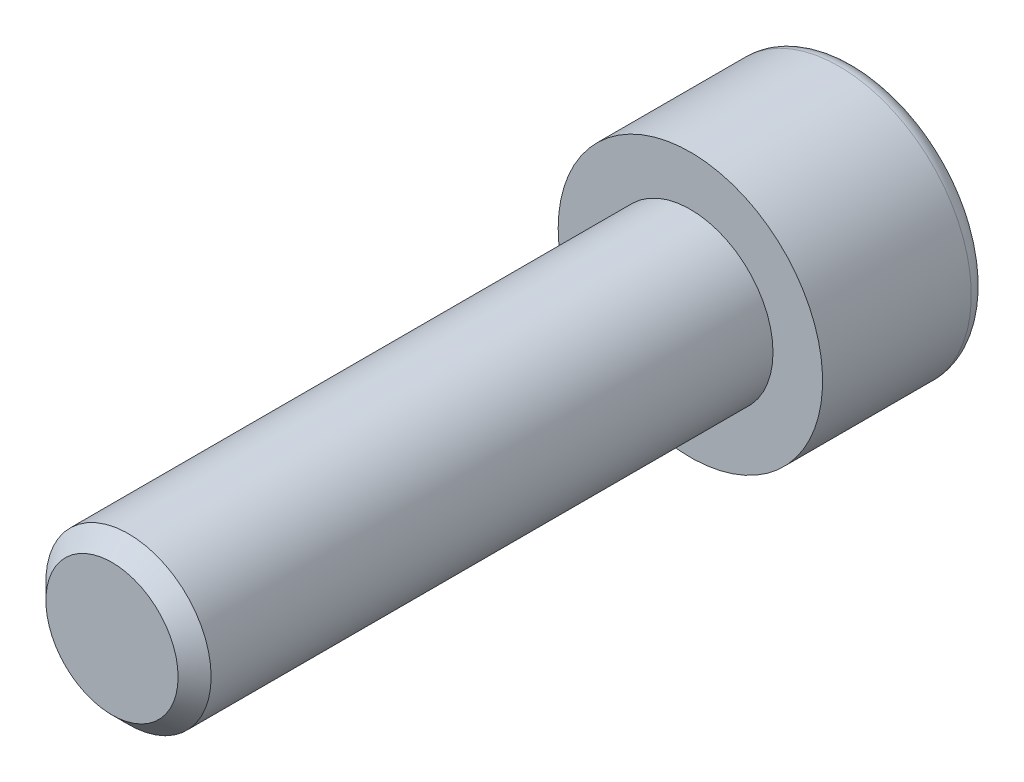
ISO-10303-21;
HEADER;
FILE_DESCRIPTION(('STEP AP214'),'2;1');
FILE_NAME('part.step','',(''),(''),'','','');
FILE_SCHEMA(('AUTOMOTIVE_DESIGN { 1 0 10303 214 1 1 1 1 }'));
ENDSEC;
DATA;
#1=APPLICATION_CONTEXT('core data for automotive mechanical design processes');
#2=APPLICATION_PROTOCOL_DEFINITION('international standard','automotive_design',2000,#1);
#3=PRODUCT_CONTEXT('',#1,'mechanical');
#4=PRODUCT('Part','Part','',(#3));
#5=PRODUCT_RELATED_PRODUCT_CATEGORY('part','',(#4));
#6=PRODUCT_DEFINITION_FORMATION('','',#4);
#7=PRODUCT_DEFINITION_CONTEXT('part definition',#1,'design');
#8=PRODUCT_DEFINITION('design','',#6,#7);
#9=PRODUCT_DEFINITION_SHAPE('','',#8);
#10=(LENGTH_UNIT() NAMED_UNIT(*) SI_UNIT(.MILLI.,.METRE.));
#11=(NAMED_UNIT(*) PLANE_ANGLE_UNIT() SI_UNIT($,.RADIAN.));
#12=(NAMED_UNIT(*) SI_UNIT($,.STERADIAN.) SOLID_ANGLE_UNIT());
#13=UNCERTAINTY_MEASURE_WITH_UNIT(LENGTH_MEASURE(1.E-05),#10,'distance_accuracy_value','');
#14=(GEOMETRIC_REPRESENTATION_CONTEXT(3) GLOBAL_UNCERTAINTY_ASSIGNED_CONTEXT((#13)) GLOBAL_UNIT_ASSIGNED_CONTEXT((#10,
#11,#12)) REPRESENTATION_CONTEXT('',''));
#15=CARTESIAN_POINT('',(0.,0.,0.));
#16=DIRECTION('',(0.,0.,1.));
#17=DIRECTION('',(1.,0.,0.));
#18=AXIS2_PLACEMENT_3D('',#15,#16,#17);
#19=CARTESIAN_POINT('',(0.,0.,-10.));
#20=DIRECTION('',(0.,0.,1.));
#21=DIRECTION('',(1.,0.,0.));
#22=AXIS2_PLACEMENT_3D('',#19,#20,#21);
#23=PLANE('',#22);
#24=CARTESIAN_POINT('',(0.,0.,-10.));
#25=DIRECTION('',(0.,0.,-1.));
#26=DIRECTION('',(-1.,0.,0.));
#27=AXIS2_PLACEMENT_3D('',#24,#25,#26);
#28=CIRCLE('',#27,7.);
#29=CARTESIAN_POINT('',(-7.,0.,-10.));
#30=VERTEX_POINT('',#29);
#31=EDGE_CURVE('E149',#30,#30,#28,.T.);
#32=ORIENTED_EDGE('',*,*,#31,.T.);
#33=EDGE_LOOP('',(#32));
#34=FACE_BOUND('',#33,.T.);
#35=DIRECTION('',(-0.86602540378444,0.499999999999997,0.));
#36=VECTOR('',#35,1.);
#37=CARTESIAN_POINT('',(0.,4.61880215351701,-10.));
#38=LINE('',#37,#36);
#39=CARTESIAN_POINT('',(4.,2.30940107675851,-10.));
#40=VERTEX_POINT('',#39);
#41=CARTESIAN_POINT('',(0.,4.61880215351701,-10.));
#42=VERTEX_POINT('',#41);
#43=EDGE_CURVE('E51',#40,#42,#38,.T.);
#44=ORIENTED_EDGE('',*,*,#43,.T.);
#45=DIRECTION('',(-0.866025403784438,-0.500000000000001,0.));
#46=VECTOR('',#45,1.);
#47=CARTESIAN_POINT('',(0.,4.61880215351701,-10.));
#48=LINE('',#47,#46);
#49=CARTESIAN_POINT('',(-4.,2.30940107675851,-10.));
#50=VERTEX_POINT('',#49);
#51=EDGE_CURVE('E122',#42,#50,#48,.T.);
#52=ORIENTED_EDGE('',*,*,#51,.T.);
#53=DIRECTION('',(0.,-1.,0.));
#54=VECTOR('',#53,1.);
#55=CARTESIAN_POINT('',(-4.,-2.30940107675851,-10.));
#56=LINE('',#55,#54);
#57=CARTESIAN_POINT('',(-4.,-2.30940107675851,-10.));
#58=VERTEX_POINT('',#57);
#59=EDGE_CURVE('E126',#50,#58,#56,.T.);
#60=ORIENTED_EDGE('',*,*,#59,.T.);
#61=DIRECTION('',(0.866025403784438,-0.500000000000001,0.));
#62=VECTOR('',#61,1.);
#63=CARTESIAN_POINT('',(0.,-4.61880215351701,-10.));
#64=LINE('',#63,#62);
#65=CARTESIAN_POINT('',(0.,-4.61880215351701,-10.));
#66=VERTEX_POINT('',#65);
#67=EDGE_CURVE('E129',#58,#66,#64,.T.);
#68=ORIENTED_EDGE('',*,*,#67,.T.);
#69=DIRECTION('',(0.86602540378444,0.499999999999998,0.));
#70=VECTOR('',#69,1.);
#71=CARTESIAN_POINT('',(0.,-4.61880215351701,-10.));
#72=LINE('',#71,#70);
#73=CARTESIAN_POINT('',(4.,-2.30940107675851,-10.));
#74=VERTEX_POINT('',#73);
#75=EDGE_CURVE('E112',#66,#74,#72,.T.);
#76=ORIENTED_EDGE('',*,*,#75,.T.);
#77=DIRECTION('',(0.,1.,0.));
#78=VECTOR('',#77,1.);
#79=CARTESIAN_POINT('',(4.,-2.30940107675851,-10.));
#80=LINE('',#79,#78);
#81=EDGE_CURVE('E132',#74,#40,#80,.T.);
#82=ORIENTED_EDGE('',*,*,#81,.T.);
#83=EDGE_LOOP('',(#44,#52,#60,#68,#76,#82));
#84=FACE_BOUND('',#83,.T.);
#85=ADVANCED_FACE('F36',(#34,#84),#23,.F.);
#86=CARTESIAN_POINT('',(0.,0.,-9.));
#87=DIRECTION('',(0.,0.,-1.));
#88=DIRECTION('',(-1.,0.,0.));
#89=AXIS2_PLACEMENT_3D('',#86,#87,#88);
#90=TOROIDAL_SURFACE('',#89,7.,0.999999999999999);
#91=ORIENTED_EDGE('',*,*,#31,.F.);
#92=EDGE_LOOP('',(#91));
#93=FACE_BOUND('',#92,.T.);
#94=CARTESIAN_POINT('',(0.,0.,-9.));
#95=DIRECTION('',(0.,0.,-1.));
#96=DIRECTION('',(-1.,0.,0.));
#97=AXIS2_PLACEMENT_3D('',#94,#95,#96);
#98=CIRCLE('',#97,8.);
#99=CARTESIAN_POINT('',(-8.,0.,-9.));
#100=VERTEX_POINT('',#99);
#101=EDGE_CURVE('E146',#100,#100,#98,.T.);
#102=ORIENTED_EDGE('',*,*,#101,.T.);
#103=EDGE_LOOP('',(#102));
#104=FACE_BOUND('',#103,.T.);
#105=ADVANCED_FACE('F167',(#93,#104),#90,.T.);
#106=CARTESIAN_POINT('',(0.,0.,0.));
#107=DIRECTION('',(0.,0.,-1.));
#108=DIRECTION('',(-1.,0.,0.));
#109=AXIS2_PLACEMENT_3D('',#106,#107,#108);
#110=CYLINDRICAL_SURFACE('',#109,8.);
#111=ORIENTED_EDGE('',*,*,#101,.F.);
#112=EDGE_LOOP('',(#111));
#113=FACE_BOUND('',#112,.T.);
#114=CARTESIAN_POINT('',(0.,0.,0.));
#115=DIRECTION('',(0.,0.,-1.));
#116=DIRECTION('',(-1.,0.,0.));
#117=AXIS2_PLACEMENT_3D('',#114,#115,#116);
#118=CIRCLE('',#117,8.);
#119=CARTESIAN_POINT('',(-8.,0.,0.));
#120=VERTEX_POINT('',#119);
#121=EDGE_CURVE('E143',#120,#120,#118,.T.);
#122=ORIENTED_EDGE('',*,*,#121,.T.);
#123=EDGE_LOOP('',(#122));
#124=FACE_BOUND('',#123,.T.);
#125=ADVANCED_FACE('F172',(#113,#124),#110,.T.);
#126=CARTESIAN_POINT('',(0.,0.,0.));
#127=DIRECTION('',(0.,0.,-1.));
#128=DIRECTION('',(-1.,0.,0.));
#129=AXIS2_PLACEMENT_3D('',#126,#127,#128);
#130=PLANE('',#129);
#131=CARTESIAN_POINT('',(0.,0.,0.));
#132=DIRECTION('',(0.,0.,1.));
#133=DIRECTION('',(1.,0.,0.));
#134=AXIS2_PLACEMENT_3D('',#131,#132,#133);
#135=CIRCLE('',#134,5.);
#136=CARTESIAN_POINT('',(5.,0.,0.));
#137=VERTEX_POINT('',#136);
#138=EDGE_CURVE('E123',#137,#137,#135,.T.);
#139=ORIENTED_EDGE('',*,*,#138,.F.);
#140=EDGE_LOOP('',(#139));
#141=FACE_BOUND('',#140,.T.);
#142=ORIENTED_EDGE('',*,*,#121,.F.);
#143=EDGE_LOOP('',(#142));
#144=FACE_BOUND('',#143,.T.);
#145=ADVANCED_FACE('F179',(#141,#144),#130,.F.);
#146=CARTESIAN_POINT('',(0.,4.61880215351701,-5.));
#147=DIRECTION('',(-0.499999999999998,-0.86602540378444,0.));
#148=DIRECTION('',(0.86602540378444,-0.499999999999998,0.));
#149=AXIS2_PLACEMENT_3D('',#146,#147,#148);
#150=PLANE('',#149);
#151=ORIENTED_EDGE('',*,*,#43,.F.);
#152=DIRECTION('',(0.,0.,-1.));
#153=VECTOR('',#152,1.);
#154=CARTESIAN_POINT('',(4.,2.30940107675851,-5.));
#155=LINE('',#154,#153);
#156=CARTESIAN_POINT('',(4.,2.30940107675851,-5.));
#157=VERTEX_POINT('',#156);
#158=EDGE_CURVE('E117',#157,#40,#155,.T.);
#159=ORIENTED_EDGE('',*,*,#158,.F.);
#160=DIRECTION('',(-0.86602540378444,0.499999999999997,0.));
#161=VECTOR('',#160,1.);
#162=CARTESIAN_POINT('',(0.,4.61880215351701,-5.));
#163=LINE('',#162,#161);
#164=CARTESIAN_POINT('',(0.,4.61880215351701,-5.));
#165=VERTEX_POINT('',#164);
#166=EDGE_CURVE('E135',#157,#165,#163,.T.);
#167=ORIENTED_EDGE('',*,*,#166,.T.);
#168=DIRECTION('',(0.,0.,-1.));
#169=VECTOR('',#168,1.);
#170=CARTESIAN_POINT('',(0.,4.61880215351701,-5.));
#171=LINE('',#170,#169);
#172=EDGE_CURVE('E141',#165,#42,#171,.T.);
#173=ORIENTED_EDGE('',*,*,#172,.T.);
#174=EDGE_LOOP('',(#151,#159,#167,#173));
#175=FACE_BOUND('',#174,.T.);
#176=ADVANCED_FACE('F183',(#175),#150,.T.);
#177=CARTESIAN_POINT('',(0.,4.61880215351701,-5.));
#178=DIRECTION('',(0.500000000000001,-0.866025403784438,0.));
#179=DIRECTION('',(0.866025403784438,0.500000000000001,0.));
#180=AXIS2_PLACEMENT_3D('',#177,#178,#179);
#181=PLANE('',#180);
#182=ORIENTED_EDGE('',*,*,#51,.F.);
#183=ORIENTED_EDGE('',*,*,#172,.F.);
#184=DIRECTION('',(-0.866025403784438,-0.500000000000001,0.));
#185=VECTOR('',#184,1.);
#186=CARTESIAN_POINT('',(0.,4.61880215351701,-5.));
#187=LINE('',#186,#185);
#188=CARTESIAN_POINT('',(-4.,2.30940107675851,-5.));
#189=VERTEX_POINT('',#188);
#190=EDGE_CURVE('E90',#165,#189,#187,.T.);
#191=ORIENTED_EDGE('',*,*,#190,.T.);
#192=DIRECTION('',(0.,0.,-1.));
#193=VECTOR('',#192,1.);
#194=CARTESIAN_POINT('',(-4.,2.30940107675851,-5.));
#195=LINE('',#194,#193);
#196=EDGE_CURVE('E139',#189,#50,#195,.T.);
#197=ORIENTED_EDGE('',*,*,#196,.T.);
#198=EDGE_LOOP('',(#182,#183,#191,#197));
#199=FACE_BOUND('',#198,.T.);
#200=ADVANCED_FACE('F187',(#199),#181,.T.);
#201=CARTESIAN_POINT('',(-4.,-2.30940107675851,-5.));
#202=DIRECTION('',(1.,0.,0.));
#203=DIRECTION('',(0.,0.,-1.));
#204=AXIS2_PLACEMENT_3D('',#201,#202,#203);
#205=PLANE('',#204);
#206=ORIENTED_EDGE('',*,*,#59,.F.);
#207=ORIENTED_EDGE('',*,*,#196,.F.);
#208=DIRECTION('',(0.,-1.,0.));
#209=VECTOR('',#208,1.);
#210=CARTESIAN_POINT('',(-4.,-2.30940107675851,-5.));
#211=LINE('',#210,#209);
#212=CARTESIAN_POINT('',(-4.,-2.30940107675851,-5.));
#213=VERTEX_POINT('',#212);
#214=EDGE_CURVE('E108',#189,#213,#211,.T.);
#215=ORIENTED_EDGE('',*,*,#214,.T.);
#216=DIRECTION('',(0.,0.,-1.));
#217=VECTOR('',#216,1.);
#218=CARTESIAN_POINT('',(-4.,-2.30940107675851,-5.));
#219=LINE('',#218,#217);
#220=EDGE_CURVE('E105',#213,#58,#219,.T.);
#221=ORIENTED_EDGE('',*,*,#220,.T.);
#222=EDGE_LOOP('',(#206,#207,#215,#221));
#223=FACE_BOUND('',#222,.T.);
#224=ADVANCED_FACE('F190',(#223),#205,.T.);
#225=CARTESIAN_POINT('',(0.,-4.61880215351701,-5.));
#226=DIRECTION('',(0.500000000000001,0.866025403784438,0.));
#227=DIRECTION('',(-0.866025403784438,0.500000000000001,0.));
#228=AXIS2_PLACEMENT_3D('',#225,#226,#227);
#229=PLANE('',#228);
#230=ORIENTED_EDGE('',*,*,#67,.F.);
#231=ORIENTED_EDGE('',*,*,#220,.F.);
#232=DIRECTION('',(0.866025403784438,-0.500000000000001,0.));
#233=VECTOR('',#232,1.);
#234=CARTESIAN_POINT('',(0.,-4.61880215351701,-5.));
#235=LINE('',#234,#233);
#236=CARTESIAN_POINT('',(0.,-4.61880215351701,-5.));
#237=VERTEX_POINT('',#236);
#238=EDGE_CURVE('E100',#213,#237,#235,.T.);
#239=ORIENTED_EDGE('',*,*,#238,.T.);
#240=DIRECTION('',(0.,0.,-1.));
#241=VECTOR('',#240,1.);
#242=CARTESIAN_POINT('',(0.,-4.61880215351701,-5.));
#243=LINE('',#242,#241);
#244=EDGE_CURVE('E104',#237,#66,#243,.T.);
#245=ORIENTED_EDGE('',*,*,#244,.T.);
#246=EDGE_LOOP('',(#230,#231,#239,#245));
#247=FACE_BOUND('',#246,.T.);
#248=ADVANCED_FACE('F103',(#247),#229,.T.);
#249=CARTESIAN_POINT('',(0.,-4.61880215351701,-5.));
#250=DIRECTION('',(-0.499999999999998,0.86602540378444,0.));
#251=DIRECTION('',(-0.86602540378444,-0.499999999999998,0.));
#252=AXIS2_PLACEMENT_3D('',#249,#250,#251);
#253=PLANE('',#252);
#254=ORIENTED_EDGE('',*,*,#75,.F.);
#255=ORIENTED_EDGE('',*,*,#244,.F.);
#256=DIRECTION('',(0.86602540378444,0.499999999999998,0.));
#257=VECTOR('',#256,1.);
#258=CARTESIAN_POINT('',(0.,-4.61880215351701,-5.));
#259=LINE('',#258,#257);
#260=CARTESIAN_POINT('',(4.,-2.30940107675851,-5.));
#261=VERTEX_POINT('',#260);
#262=EDGE_CURVE('E107',#237,#261,#259,.T.);
#263=ORIENTED_EDGE('',*,*,#262,.T.);
#264=DIRECTION('',(0.,0.,-1.));
#265=VECTOR('',#264,1.);
#266=CARTESIAN_POINT('',(4.,-2.30940107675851,-5.));
#267=LINE('',#266,#265);
#268=EDGE_CURVE('E81',#261,#74,#267,.T.);
#269=ORIENTED_EDGE('',*,*,#268,.T.);
#270=EDGE_LOOP('',(#254,#255,#263,#269));
#271=FACE_BOUND('',#270,.T.);
#272=ADVANCED_FACE('F110',(#271),#253,.T.);
#273=CARTESIAN_POINT('',(4.,-2.30940107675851,-5.));
#274=DIRECTION('',(-1.,0.,0.));
#275=DIRECTION('',(0.,-1.,0.));
#276=AXIS2_PLACEMENT_3D('',#273,#274,#275);
#277=PLANE('',#276);
#278=ORIENTED_EDGE('',*,*,#81,.F.);
#279=ORIENTED_EDGE('',*,*,#268,.F.);
#280=DIRECTION('',(0.,1.,0.));
#281=VECTOR('',#280,1.);
#282=CARTESIAN_POINT('',(4.,-2.30940107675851,-5.));
#283=LINE('',#282,#281);
#284=EDGE_CURVE('E59',#261,#157,#283,.T.);
#285=ORIENTED_EDGE('',*,*,#284,.T.);
#286=ORIENTED_EDGE('',*,*,#158,.T.);
#287=EDGE_LOOP('',(#278,#279,#285,#286));
#288=FACE_BOUND('',#287,.T.);
#289=ADVANCED_FACE('F199',(#288),#277,.T.);
#290=CARTESIAN_POINT('',(4.,2.30940107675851,-5.));
#291=DIRECTION('',(0.,0.,1.));
#292=DIRECTION('',(1.,0.,0.));
#293=AXIS2_PLACEMENT_3D('',#290,#291,#292);
#294=PLANE('',#293);
#295=ORIENTED_EDGE('',*,*,#166,.F.);
#296=ORIENTED_EDGE('',*,*,#284,.F.);
#297=ORIENTED_EDGE('',*,*,#262,.F.);
#298=ORIENTED_EDGE('',*,*,#238,.F.);
#299=ORIENTED_EDGE('',*,*,#214,.F.);
#300=ORIENTED_EDGE('',*,*,#190,.F.);
#301=EDGE_LOOP('',(#295,#296,#297,#298,#299,#300));
#302=FACE_BOUND('',#301,.T.);
#303=ADVANCED_FACE('F115',(#302),#294,.F.);
#304=CARTESIAN_POINT('',(0.,0.,35.));
#305=DIRECTION('',(0.,0.,1.));
#306=DIRECTION('',(1.,0.,0.));
#307=AXIS2_PLACEMENT_3D('',#304,#305,#306);
#308=PLANE('',#307);
#309=CARTESIAN_POINT('',(0.,0.,35.));
#310=DIRECTION('',(0.,0.,1.));
#311=DIRECTION('',(1.,0.,0.));
#312=AXIS2_PLACEMENT_3D('',#309,#310,#311);
#313=CIRCLE('',#312,4.);
#314=CARTESIAN_POINT('',(4.00000000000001,0.,35.));
#315=VERTEX_POINT('',#314);
#316=EDGE_CURVE('E44',#315,#315,#313,.T.);
#317=ORIENTED_EDGE('',*,*,#316,.T.);
#318=EDGE_LOOP('',(#317));
#319=FACE_BOUND('',#318,.T.);
#320=ADVANCED_FACE('F154',(#319),#308,.T.);
#321=CARTESIAN_POINT('',(0.,0.,0.));
#322=DIRECTION('',(0.,0.,1.));
#323=DIRECTION('',(1.,0.,0.));
#324=AXIS2_PLACEMENT_3D('',#321,#322,#323);
#325=CYLINDRICAL_SURFACE('',#324,5.);
#326=CARTESIAN_POINT('',(0.,0.,34.));
#327=DIRECTION('',(0.,0.,1.));
#328=DIRECTION('',(1.,0.,0.));
#329=AXIS2_PLACEMENT_3D('',#326,#327,#328);
#330=CIRCLE('',#329,5.);
#331=CARTESIAN_POINT('',(5.,0.,34.));
#332=VERTEX_POINT('',#331);
#333=EDGE_CURVE('E11',#332,#332,#330,.F.);
#334=ORIENTED_EDGE('',*,*,#333,.T.);
#335=EDGE_LOOP('',(#334));
#336=FACE_BOUND('',#335,.T.);
#337=ORIENTED_EDGE('',*,*,#138,.T.);
#338=EDGE_LOOP('',(#337));
#339=FACE_BOUND('',#338,.T.);
#340=ADVANCED_FACE('F157',(#336,#339),#325,.T.);
#341=CARTESIAN_POINT('',(0.,0.,35.));
#342=DIRECTION('',(0.,0.,-1.));
#343=DIRECTION('',(-1.,0.,0.));
#344=AXIS2_PLACEMENT_3D('',#341,#342,#343);
#345=CONICAL_SURFACE('',#344,4.,0.785398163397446);
#346=ORIENTED_EDGE('',*,*,#333,.F.);
#347=EDGE_LOOP('',(#346));
#348=FACE_BOUND('',#347,.T.);
#349=ORIENTED_EDGE('',*,*,#316,.F.);
#350=EDGE_LOOP('',(#349));
#351=FACE_BOUND('',#350,.T.);
#352=ADVANCED_FACE('F38',(#348,#351),#345,.T.);
#353=CLOSED_SHELL('',(#85,#105,#125,#145,#176,#200,#224,#248,#272,#289,#303,#320,#340,#352));
#354=MANIFOLD_SOLID_BREP('B2',#353);
#355=ADVANCED_BREP_SHAPE_REPRESENTATION('',(#18,#354),#14);
#356=SHAPE_DEFINITION_REPRESENTATION(#9,#355);
ENDSEC;
END-ISO-10303-21;
